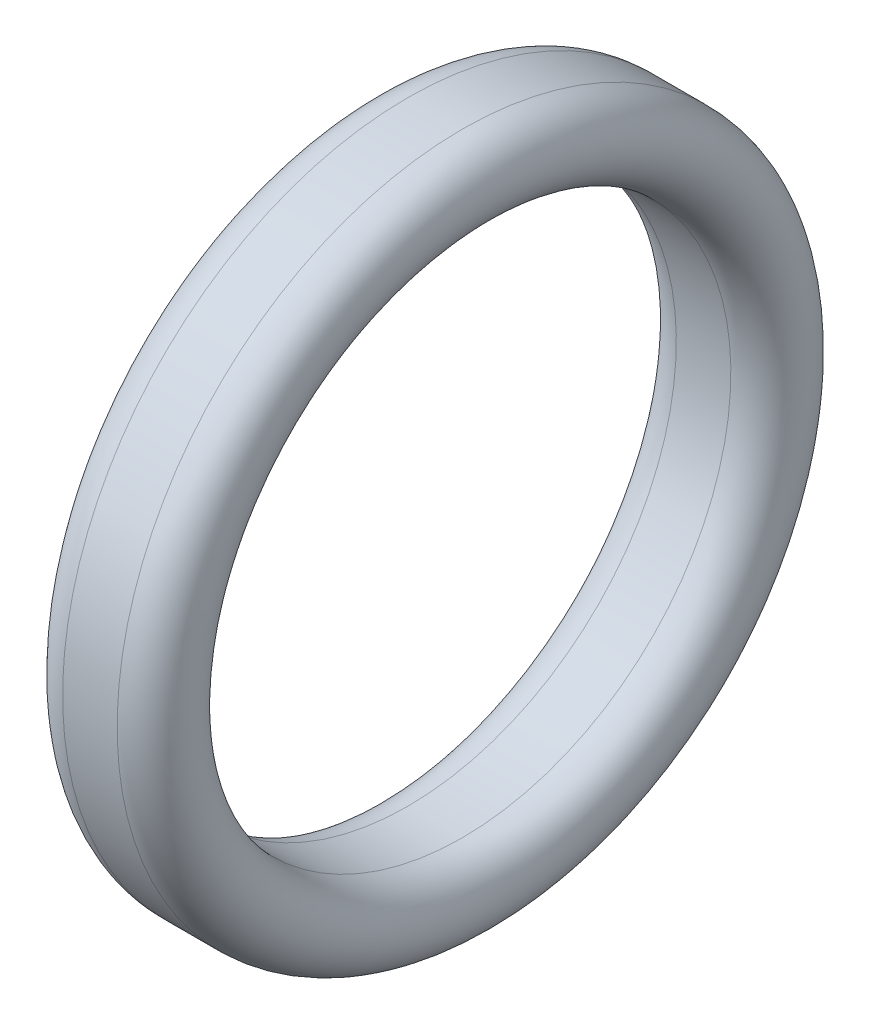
ISO-10303-21;
HEADER;
FILE_DESCRIPTION(('STEP AP214'),'2;1');
FILE_NAME('part.step','',(''),(''),'','','');
FILE_SCHEMA(('AUTOMOTIVE_DESIGN { 1 0 10303 214 1 1 1 1 }'));
ENDSEC;
DATA;
#1=APPLICATION_CONTEXT('core data for automotive mechanical design processes');
#2=APPLICATION_PROTOCOL_DEFINITION('international standard','automotive_design',2000,#1);
#3=PRODUCT_CONTEXT('',#1,'mechanical');
#4=PRODUCT('Part','Part','',(#3));
#5=PRODUCT_RELATED_PRODUCT_CATEGORY('part','',(#4));
#6=PRODUCT_DEFINITION_FORMATION('','',#4);
#7=PRODUCT_DEFINITION_CONTEXT('part definition',#1,'design');
#8=PRODUCT_DEFINITION('design','',#6,#7);
#9=PRODUCT_DEFINITION_SHAPE('','',#8);
#10=(LENGTH_UNIT() NAMED_UNIT(*) SI_UNIT(.MILLI.,.METRE.));
#11=(NAMED_UNIT(*) PLANE_ANGLE_UNIT() SI_UNIT($,.RADIAN.));
#12=(NAMED_UNIT(*) SI_UNIT($,.STERADIAN.) SOLID_ANGLE_UNIT());
#13=UNCERTAINTY_MEASURE_WITH_UNIT(LENGTH_MEASURE(1.E-05),#10,'distance_accuracy_value','');
#14=(GEOMETRIC_REPRESENTATION_CONTEXT(3) GLOBAL_UNCERTAINTY_ASSIGNED_CONTEXT((#13)) GLOBAL_UNIT_ASSIGNED_CONTEXT((#10,
#11,#12)) REPRESENTATION_CONTEXT('',''));
#15=CARTESIAN_POINT('',(0.,0.,0.));
#16=DIRECTION('',(0.,0.,1.));
#17=DIRECTION('',(1.,0.,0.));
#18=AXIS2_PLACEMENT_3D('',#15,#16,#17);
#19=CARTESIAN_POINT('',(-54.7903,0.,0.));
#20=DIRECTION('',(-1.,0.,0.));
#21=DIRECTION('',(0.,-1.,0.));
#22=AXIS2_PLACEMENT_3D('',#19,#20,#21);
#23=TOROIDAL_SURFACE('',#22,11.2903,1.4097);
#24=CARTESIAN_POINT('',(-54.7903,0.,0.));
#25=DIRECTION('',(-1.,0.,0.));
#26=DIRECTION('',(0.,-1.,0.));
#27=AXIS2_PLACEMENT_3D('',#24,#25,#26);
#28=CIRCLE('',#27,9.8806);
#29=CARTESIAN_POINT('',(-54.7903,-9.8806,0.));
#30=VERTEX_POINT('',#29);
#31=EDGE_CURVE('E10',#30,#30,#28,.T.);
#32=ORIENTED_EDGE('',*,*,#31,.F.);
#33=EDGE_LOOP('',(#32));
#34=FACE_BOUND('',#33,.T.);
#35=CARTESIAN_POINT('',(-54.7903,0.,0.));
#36=DIRECTION('',(-1.,0.,0.));
#37=DIRECTION('',(0.,-1.,0.));
#38=AXIS2_PLACEMENT_3D('',#35,#36,#37);
#39=CIRCLE('',#38,12.7);
#40=CARTESIAN_POINT('',(-54.7903,-12.7,0.));
#41=VERTEX_POINT('',#40);
#42=EDGE_CURVE('E43',#41,#41,#39,.T.);
#43=ORIENTED_EDGE('',*,*,#42,.T.);
#44=EDGE_LOOP('',(#43));
#45=FACE_BOUND('',#44,.T.);
#46=ADVANCED_FACE('F29',(#34,#45),#23,.T.);
#47=CARTESIAN_POINT('',(-75.,0.,0.));
#48=DIRECTION('',(-1.,0.,0.));
#49=DIRECTION('',(0.,-1.,0.));
#50=AXIS2_PLACEMENT_3D('',#47,#48,#49);
#51=CYLINDRICAL_SURFACE('',#50,9.8806);
#52=CARTESIAN_POINT('',(-52.7837,0.,0.));
#53=DIRECTION('',(-1.,0.,0.));
#54=DIRECTION('',(0.,-1.,0.));
#55=AXIS2_PLACEMENT_3D('',#52,#53,#54);
#56=CIRCLE('',#55,9.8806);
#57=CARTESIAN_POINT('',(-52.7837,-9.8806,0.));
#58=VERTEX_POINT('',#57);
#59=EDGE_CURVE('E35',#58,#58,#56,.T.);
#60=ORIENTED_EDGE('',*,*,#59,.F.);
#61=EDGE_LOOP('',(#60));
#62=FACE_BOUND('',#61,.T.);
#63=ORIENTED_EDGE('',*,*,#31,.T.);
#64=EDGE_LOOP('',(#63));
#65=FACE_BOUND('',#64,.T.);
#66=ADVANCED_FACE('F58',(#62,#65),#51,.F.);
#67=CARTESIAN_POINT('',(-52.7837,0.,0.));
#68=DIRECTION('',(-1.,0.,0.));
#69=DIRECTION('',(0.,-1.,0.));
#70=AXIS2_PLACEMENT_3D('',#67,#68,#69);
#71=TOROIDAL_SURFACE('',#70,11.2903,1.4097);
#72=CARTESIAN_POINT('',(-52.7837,0.,0.));
#73=DIRECTION('',(-1.,0.,0.));
#74=DIRECTION('',(0.,-1.,0.));
#75=AXIS2_PLACEMENT_3D('',#72,#73,#74);
#76=CIRCLE('',#75,12.7);
#77=CARTESIAN_POINT('',(-52.7837,-12.7,0.));
#78=VERTEX_POINT('',#77);
#79=EDGE_CURVE('E39',#78,#78,#76,.T.);
#80=ORIENTED_EDGE('',*,*,#79,.F.);
#81=EDGE_LOOP('',(#80));
#82=FACE_BOUND('',#81,.T.);
#83=ORIENTED_EDGE('',*,*,#59,.T.);
#84=EDGE_LOOP('',(#83));
#85=FACE_BOUND('',#84,.T.);
#86=ADVANCED_FACE('F53',(#82,#85),#71,.T.);
#87=CARTESIAN_POINT('',(-75.,0.,0.));
#88=DIRECTION('',(-1.,0.,0.));
#89=DIRECTION('',(0.,-1.,0.));
#90=AXIS2_PLACEMENT_3D('',#87,#88,#89);
#91=CYLINDRICAL_SURFACE('',#90,12.7);
#92=ORIENTED_EDGE('',*,*,#42,.F.);
#93=EDGE_LOOP('',(#92));
#94=FACE_BOUND('',#93,.T.);
#95=ORIENTED_EDGE('',*,*,#79,.T.);
#96=EDGE_LOOP('',(#95));
#97=FACE_BOUND('',#96,.T.);
#98=ADVANCED_FACE('F50',(#94,#97),#91,.T.);
#99=CLOSED_SHELL('',(#46,#66,#86,#98));
#100=MANIFOLD_SOLID_BREP('B2',#99);
#101=ADVANCED_BREP_SHAPE_REPRESENTATION('',(#18,#100),#14);
#102=SHAPE_DEFINITION_REPRESENTATION(#9,#101);
ENDSEC;
END-ISO-10303-21;
